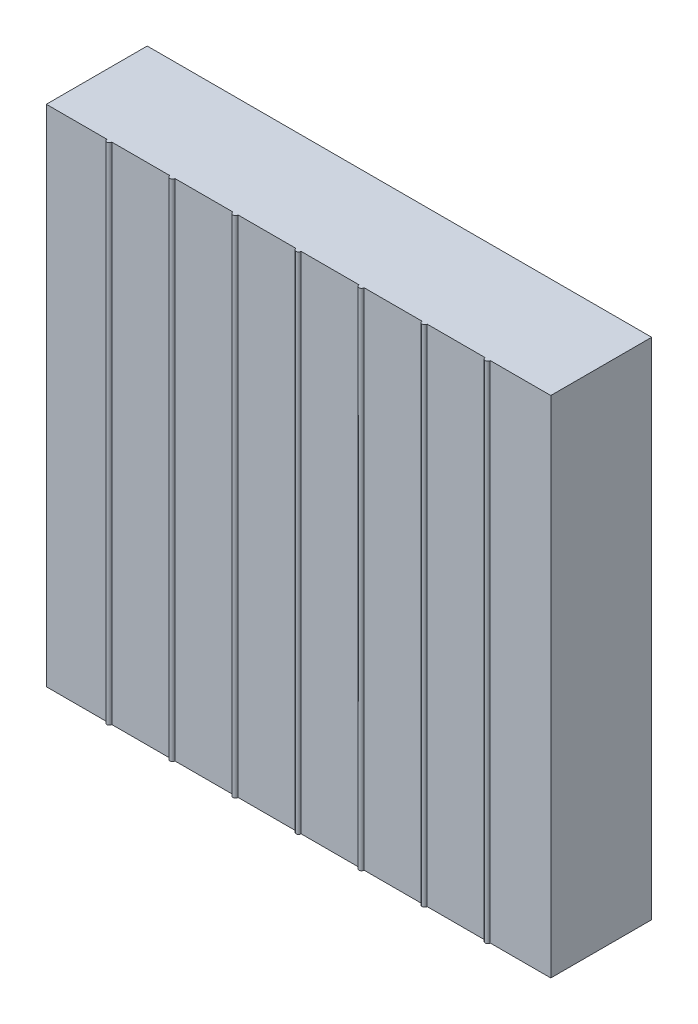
ISO-10303-21;
HEADER;
FILE_DESCRIPTION(('STEP AP214'),'2;1');
FILE_NAME('part.step','',(''),(''),'','','');
FILE_SCHEMA(('AUTOMOTIVE_DESIGN { 1 0 10303 214 1 1 1 1 }'));
ENDSEC;
DATA;
#1=APPLICATION_CONTEXT('core data for automotive mechanical design processes');
#2=APPLICATION_PROTOCOL_DEFINITION('international standard','automotive_design',2000,#1);
#3=PRODUCT_CONTEXT('',#1,'mechanical');
#4=PRODUCT('Part','Part','',(#3));
#5=PRODUCT_RELATED_PRODUCT_CATEGORY('part','',(#4));
#6=PRODUCT_DEFINITION_FORMATION('','',#4);
#7=PRODUCT_DEFINITION_CONTEXT('part definition',#1,'design');
#8=PRODUCT_DEFINITION('design','',#6,#7);
#9=PRODUCT_DEFINITION_SHAPE('','',#8);
#10=(LENGTH_UNIT() NAMED_UNIT(*) SI_UNIT(.MILLI.,.METRE.));
#11=(NAMED_UNIT(*) PLANE_ANGLE_UNIT() SI_UNIT($,.RADIAN.));
#12=(NAMED_UNIT(*) SI_UNIT($,.STERADIAN.) SOLID_ANGLE_UNIT());
#13=UNCERTAINTY_MEASURE_WITH_UNIT(LENGTH_MEASURE(1.E-05),#10,'distance_accuracy_value','');
#14=(GEOMETRIC_REPRESENTATION_CONTEXT(3) GLOBAL_UNCERTAINTY_ASSIGNED_CONTEXT((#13)) GLOBAL_UNIT_ASSIGNED_CONTEXT((#10,
#11,#12)) REPRESENTATION_CONTEXT('',''));
#15=CARTESIAN_POINT('',(0.,0.,0.));
#16=DIRECTION('',(0.,0.,1.));
#17=DIRECTION('',(1.,0.,0.));
#18=AXIS2_PLACEMENT_3D('',#15,#16,#17);
#19=CARTESIAN_POINT('',(-10.,10.,4.));
#20=DIRECTION('',(0.,0.,1.));
#21=DIRECTION('',(1.,0.,0.));
#22=AXIS2_PLACEMENT_3D('',#19,#20,#21);
#23=PLANE('',#22);
#24=DIRECTION('',(0.,1.,0.));
#25=VECTOR('',#24,1.);
#26=CARTESIAN_POINT('',(7.6,-10.22360679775,3.99999999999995));
#27=LINE('',#26,#25);
#28=CARTESIAN_POINT('',(7.6,-10.,4.));
#29=VERTEX_POINT('',#28);
#30=CARTESIAN_POINT('',(7.6,10.,4.));
#31=VERTEX_POINT('',#30);
#32=EDGE_CURVE('E47',#29,#31,#27,.T.);
#33=ORIENTED_EDGE('',*,*,#32,.F.);
#34=DIRECTION('',(1.,0.,0.));
#35=VECTOR('',#34,1.);
#36=CARTESIAN_POINT('',(-10.,-10.,4.));
#37=LINE('',#36,#35);
#38=CARTESIAN_POINT('',(10.,-10.,4.));
#39=VERTEX_POINT('',#38);
#40=EDGE_CURVE('E259',#29,#39,#37,.T.);
#41=ORIENTED_EDGE('',*,*,#40,.T.);
#42=DIRECTION('',(0.,1.,0.));
#43=VECTOR('',#42,1.);
#44=CARTESIAN_POINT('',(10.,10.,4.));
#45=LINE('',#44,#43);
#46=CARTESIAN_POINT('',(10.,10.,4.));
#47=VERTEX_POINT('',#46);
#48=EDGE_CURVE('E262',#39,#47,#45,.T.);
#49=ORIENTED_EDGE('',*,*,#48,.T.);
#50=DIRECTION('',(-1.,0.,0.));
#51=VECTOR('',#50,1.);
#52=CARTESIAN_POINT('',(-10.,10.,4.));
#53=LINE('',#52,#51);
#54=EDGE_CURVE('E166',#47,#31,#53,.T.);
#55=ORIENTED_EDGE('',*,*,#54,.T.);
#56=EDGE_LOOP('',(#33,#41,#49,#55));
#57=FACE_BOUND('',#56,.T.);
#58=ADVANCED_FACE('F32',(#57),#23,.T.);
#59=DIRECTION('',(0.,1.,0.));
#60=VECTOR('',#59,1.);
#61=CARTESIAN_POINT('',(7.4,-10.22360679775,3.99999999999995));
#62=LINE('',#61,#60);
#63=CARTESIAN_POINT('',(7.4,-10.,4.));
#64=VERTEX_POINT('',#63);
#65=CARTESIAN_POINT('',(7.4,10.,3.99999999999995));
#66=VERTEX_POINT('',#65);
#67=EDGE_CURVE('E170',#64,#66,#62,.T.);
#68=ORIENTED_EDGE('',*,*,#67,.T.);
#69=CARTESIAN_POINT('',(5.1,10.,4.));
#70=VERTEX_POINT('',#69);
#71=EDGE_CURVE('E158',#66,#70,#53,.T.);
#72=ORIENTED_EDGE('',*,*,#71,.T.);
#73=DIRECTION('',(0.,1.,0.));
#74=VECTOR('',#73,1.);
#75=CARTESIAN_POINT('',(5.1,-10.22360679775,3.99999999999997));
#76=LINE('',#75,#74);
#77=CARTESIAN_POINT('',(5.1,-10.,4.));
#78=VERTEX_POINT('',#77);
#79=EDGE_CURVE('E187',#78,#70,#76,.T.);
#80=ORIENTED_EDGE('',*,*,#79,.F.);
#81=EDGE_CURVE('E55',#78,#64,#37,.T.);
#82=ORIENTED_EDGE('',*,*,#81,.T.);
#83=EDGE_LOOP('',(#68,#72,#80,#82));
#84=FACE_BOUND('',#83,.T.);
#85=ADVANCED_FACE('F171',(#84),#23,.T.);
#86=DIRECTION('',(0.,1.,0.));
#87=VECTOR('',#86,1.);
#88=CARTESIAN_POINT('',(4.9,-10.22360679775,3.99999999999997));
#89=LINE('',#88,#87);
#90=CARTESIAN_POINT('',(4.9,-10.,4.));
#91=VERTEX_POINT('',#90);
#92=CARTESIAN_POINT('',(4.9,10.,3.99999999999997));
#93=VERTEX_POINT('',#92);
#94=EDGE_CURVE('E185',#91,#93,#89,.T.);
#95=ORIENTED_EDGE('',*,*,#94,.T.);
#96=CARTESIAN_POINT('',(2.6,10.,4.));
#97=VERTEX_POINT('',#96);
#98=EDGE_CURVE('E167',#93,#97,#53,.T.);
#99=ORIENTED_EDGE('',*,*,#98,.T.);
#100=DIRECTION('',(0.,1.,0.));
#101=VECTOR('',#100,1.);
#102=CARTESIAN_POINT('',(2.6,-10.22360679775,3.99999999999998));
#103=LINE('',#102,#101);
#104=CARTESIAN_POINT('',(2.6,-10.,4.));
#105=VERTEX_POINT('',#104);
#106=EDGE_CURVE('E198',#105,#97,#103,.T.);
#107=ORIENTED_EDGE('',*,*,#106,.F.);
#108=EDGE_CURVE('E322',#105,#91,#37,.T.);
#109=ORIENTED_EDGE('',*,*,#108,.T.);
#110=EDGE_LOOP('',(#95,#99,#107,#109));
#111=FACE_BOUND('',#110,.T.);
#112=ADVANCED_FACE('F331',(#111),#23,.T.);
#113=DIRECTION('',(0.,1.,0.));
#114=VECTOR('',#113,1.);
#115=CARTESIAN_POINT('',(-7.4,-10.22360679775,4.));
#116=LINE('',#115,#114);
#117=CARTESIAN_POINT('',(-7.4,-10.,4.));
#118=VERTEX_POINT('',#117);
#119=CARTESIAN_POINT('',(-7.4,10.,4.));
#120=VERTEX_POINT('',#119);
#121=EDGE_CURVE('E210',#118,#120,#116,.T.);
#122=ORIENTED_EDGE('',*,*,#121,.F.);
#123=CARTESIAN_POINT('',(-5.1,-10.,4.));
#124=VERTEX_POINT('',#123);
#125=EDGE_CURVE('E263',#118,#124,#37,.T.);
#126=ORIENTED_EDGE('',*,*,#125,.T.);
#127=DIRECTION('',(0.,1.,0.));
#128=VECTOR('',#127,1.);
#129=CARTESIAN_POINT('',(-5.1,-10.22360679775,4.));
#130=LINE('',#129,#128);
#131=CARTESIAN_POINT('',(-5.1,10.,4.));
#132=VERTEX_POINT('',#131);
#133=EDGE_CURVE('E218',#124,#132,#130,.T.);
#134=ORIENTED_EDGE('',*,*,#133,.T.);
#135=EDGE_CURVE('E294',#132,#120,#53,.T.);
#136=ORIENTED_EDGE('',*,*,#135,.T.);
#137=EDGE_LOOP('',(#122,#126,#134,#136));
#138=FACE_BOUND('',#137,.T.);
#139=ADVANCED_FACE('F316',(#138),#23,.T.);
#140=DIRECTION('',(0.,1.,0.));
#141=VECTOR('',#140,1.);
#142=CARTESIAN_POINT('',(-4.9,-10.22360679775,4.));
#143=LINE('',#142,#141);
#144=CARTESIAN_POINT('',(-4.9,-10.,4.));
#145=VERTEX_POINT('',#144);
#146=CARTESIAN_POINT('',(-4.9,10.,4.));
#147=VERTEX_POINT('',#146);
#148=EDGE_CURVE('E221',#145,#147,#143,.T.);
#149=ORIENTED_EDGE('',*,*,#148,.F.);
#150=CARTESIAN_POINT('',(-2.6,-10.,4.));
#151=VERTEX_POINT('',#150);
#152=EDGE_CURVE('E321',#145,#151,#37,.T.);
#153=ORIENTED_EDGE('',*,*,#152,.T.);
#154=DIRECTION('',(0.,1.,0.));
#155=VECTOR('',#154,1.);
#156=CARTESIAN_POINT('',(-2.6,-10.22360679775,4.));
#157=LINE('',#156,#155);
#158=CARTESIAN_POINT('',(-2.6,10.,4.));
#159=VERTEX_POINT('',#158);
#160=EDGE_CURVE('E229',#151,#159,#157,.T.);
#161=ORIENTED_EDGE('',*,*,#160,.T.);
#162=EDGE_CURVE('E296',#159,#147,#53,.T.);
#163=ORIENTED_EDGE('',*,*,#162,.T.);
#164=EDGE_LOOP('',(#149,#153,#161,#163));
#165=FACE_BOUND('',#164,.T.);
#166=ADVANCED_FACE('F305',(#165),#23,.T.);
#167=DIRECTION('',(0.,1.,0.));
#168=VECTOR('',#167,1.);
#169=CARTESIAN_POINT('',(-2.4,-10.22360679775,4.));
#170=LINE('',#169,#168);
#171=CARTESIAN_POINT('',(-2.4,-10.,4.));
#172=VERTEX_POINT('',#171);
#173=CARTESIAN_POINT('',(-2.4,10.,4.));
#174=VERTEX_POINT('',#173);
#175=EDGE_CURVE('E232',#172,#174,#170,.T.);
#176=ORIENTED_EDGE('',*,*,#175,.F.);
#177=CARTESIAN_POINT('',(-0.100000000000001,-10.,4.));
#178=VERTEX_POINT('',#177);
#179=EDGE_CURVE('E323',#172,#178,#37,.T.);
#180=ORIENTED_EDGE('',*,*,#179,.T.);
#181=DIRECTION('',(0.,1.,0.));
#182=VECTOR('',#181,1.);
#183=CARTESIAN_POINT('',(-0.1,-10.22360679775,4.));
#184=LINE('',#183,#182);
#185=CARTESIAN_POINT('',(-0.100000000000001,10.,4.));
#186=VERTEX_POINT('',#185);
#187=EDGE_CURVE('E241',#178,#186,#184,.T.);
#188=ORIENTED_EDGE('',*,*,#187,.T.);
#189=EDGE_CURVE('E268',#186,#174,#53,.T.);
#190=ORIENTED_EDGE('',*,*,#189,.T.);
#191=EDGE_LOOP('',(#176,#180,#188,#190));
#192=FACE_BOUND('',#191,.T.);
#193=ADVANCED_FACE('F343',(#192),#23,.T.);
#194=DIRECTION('',(0.,1.,0.));
#195=VECTOR('',#194,1.);
#196=CARTESIAN_POINT('',(2.4,-10.22360679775,3.99999999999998));
#197=LINE('',#196,#195);
#198=CARTESIAN_POINT('',(2.4,-10.,4.));
#199=VERTEX_POINT('',#198);
#200=CARTESIAN_POINT('',(2.4,10.,3.99999999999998));
#201=VERTEX_POINT('',#200);
#202=EDGE_CURVE('E195',#199,#201,#197,.T.);
#203=ORIENTED_EDGE('',*,*,#202,.T.);
#204=CARTESIAN_POINT('',(0.100000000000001,10.,4.));
#205=VERTEX_POINT('',#204);
#206=EDGE_CURVE('E295',#201,#205,#53,.T.);
#207=ORIENTED_EDGE('',*,*,#206,.T.);
#208=DIRECTION('',(0.,1.,0.));
#209=VECTOR('',#208,1.);
#210=CARTESIAN_POINT('',(0.1,-10.22360679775,4.));
#211=LINE('',#210,#209);
#212=CARTESIAN_POINT('',(0.1,-10.,4.));
#213=VERTEX_POINT('',#212);
#214=EDGE_CURVE('E244',#213,#205,#211,.T.);
#215=ORIENTED_EDGE('',*,*,#214,.F.);
#216=EDGE_CURVE('E264',#213,#199,#37,.T.);
#217=ORIENTED_EDGE('',*,*,#216,.T.);
#218=EDGE_LOOP('',(#203,#207,#215,#217));
#219=FACE_BOUND('',#218,.T.);
#220=ADVANCED_FACE('F338',(#219),#23,.T.);
#221=CARTESIAN_POINT('',(-10.,10.,4.));
#222=DIRECTION('',(1.,0.,0.));
#223=DIRECTION('',(0.,0.,-1.));
#224=AXIS2_PLACEMENT_3D('',#221,#222,#223);
#225=PLANE('',#224);
#226=DIRECTION('',(0.,-1.,0.));
#227=VECTOR('',#226,1.);
#228=CARTESIAN_POINT('',(-10.,10.,0.));
#229=LINE('',#228,#227);
#230=CARTESIAN_POINT('',(-10.,10.,0.));
#231=VERTEX_POINT('',#230);
#232=CARTESIAN_POINT('',(-10.,-10.,0.));
#233=VERTEX_POINT('',#232);
#234=EDGE_CURVE('E240',#231,#233,#229,.T.);
#235=ORIENTED_EDGE('',*,*,#234,.T.);
#236=DIRECTION('',(0.,0.,-1.));
#237=VECTOR('',#236,1.);
#238=CARTESIAN_POINT('',(-10.,-10.,4.));
#239=LINE('',#238,#237);
#240=CARTESIAN_POINT('',(-10.,-10.,4.));
#241=VERTEX_POINT('',#240);
#242=EDGE_CURVE('E11',#241,#233,#239,.T.);
#243=ORIENTED_EDGE('',*,*,#242,.F.);
#244=DIRECTION('',(0.,-1.,0.));
#245=VECTOR('',#244,1.);
#246=CARTESIAN_POINT('',(-10.,10.,4.));
#247=LINE('',#246,#245);
#248=CARTESIAN_POINT('',(-10.,10.,4.));
#249=VERTEX_POINT('',#248);
#250=EDGE_CURVE('E256',#249,#241,#247,.T.);
#251=ORIENTED_EDGE('',*,*,#250,.F.);
#252=DIRECTION('',(0.,0.,-1.));
#253=VECTOR('',#252,1.);
#254=CARTESIAN_POINT('',(-10.,10.,4.));
#255=LINE('',#254,#253);
#256=EDGE_CURVE('E267',#249,#231,#255,.T.);
#257=ORIENTED_EDGE('',*,*,#256,.T.);
#258=EDGE_LOOP('',(#235,#243,#251,#257));
#259=FACE_BOUND('',#258,.T.);
#260=ADVANCED_FACE('F34',(#259),#225,.F.);
#261=CARTESIAN_POINT('',(-10.,-10.,4.));
#262=DIRECTION('',(0.,1.,0.));
#263=DIRECTION('',(-1.,0.,0.));
#264=AXIS2_PLACEMENT_3D('',#261,#262,#263);
#265=PLANE('',#264);
#266=DIRECTION('',(1.,0.,0.));
#267=VECTOR('',#266,1.);
#268=CARTESIAN_POINT('',(-10.,-10.,0.));
#269=LINE('',#268,#267);
#270=CARTESIAN_POINT('',(10.,-10.,0.));
#271=VERTEX_POINT('',#270);
#272=EDGE_CURVE('E250',#233,#271,#269,.T.);
#273=ORIENTED_EDGE('',*,*,#272,.T.);
#274=DIRECTION('',(0.,0.,-1.));
#275=VECTOR('',#274,1.);
#276=CARTESIAN_POINT('',(10.,-10.,4.));
#277=LINE('',#276,#275);
#278=EDGE_CURVE('E40',#39,#271,#277,.T.);
#279=ORIENTED_EDGE('',*,*,#278,.F.);
#280=ORIENTED_EDGE('',*,*,#40,.F.);
#281=CARTESIAN_POINT('',(7.5,-10.,3.99999999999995));
#282=DIRECTION('',(0.,1.,0.));
#283=DIRECTION('',(-1.,0.,0.));
#284=AXIS2_PLACEMENT_3D('',#281,#282,#283);
#285=CIRCLE('',#284,0.1);
#286=EDGE_CURVE('E174',#29,#64,#285,.F.);
#287=ORIENTED_EDGE('',*,*,#286,.T.);
#288=ORIENTED_EDGE('',*,*,#81,.F.);
#289=CARTESIAN_POINT('',(5.,-10.,3.99999999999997));
#290=DIRECTION('',(0.,1.,0.));
#291=DIRECTION('',(-1.,0.,0.));
#292=AXIS2_PLACEMENT_3D('',#289,#290,#291);
#293=CIRCLE('',#292,0.1);
#294=EDGE_CURVE('E181',#78,#91,#293,.F.);
#295=ORIENTED_EDGE('',*,*,#294,.T.);
#296=ORIENTED_EDGE('',*,*,#108,.F.);
#297=CARTESIAN_POINT('',(2.5,-10.,3.99999999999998));
#298=DIRECTION('',(0.,1.,0.));
#299=DIRECTION('',(-1.,0.,0.));
#300=AXIS2_PLACEMENT_3D('',#297,#298,#299);
#301=CIRCLE('',#300,0.1);
#302=EDGE_CURVE('E191',#105,#199,#301,.F.);
#303=ORIENTED_EDGE('',*,*,#302,.T.);
#304=ORIENTED_EDGE('',*,*,#216,.F.);
#305=CARTESIAN_POINT('',(0.,-10.,4.));
#306=DIRECTION('',(0.,1.,0.));
#307=DIRECTION('',(-1.,0.,0.));
#308=AXIS2_PLACEMENT_3D('',#305,#306,#307);
#309=CIRCLE('',#308,0.1);
#310=EDGE_CURVE('E237',#213,#178,#309,.F.);
#311=ORIENTED_EDGE('',*,*,#310,.T.);
#312=ORIENTED_EDGE('',*,*,#179,.F.);
#313=CARTESIAN_POINT('',(-2.5,-10.,4.));
#314=DIRECTION('',(0.,1.,0.));
#315=DIRECTION('',(-1.,0.,0.));
#316=AXIS2_PLACEMENT_3D('',#313,#314,#315);
#317=CIRCLE('',#316,0.1);
#318=EDGE_CURVE('E225',#172,#151,#317,.F.);
#319=ORIENTED_EDGE('',*,*,#318,.T.);
#320=ORIENTED_EDGE('',*,*,#152,.F.);
#321=CARTESIAN_POINT('',(-5.,-10.,4.));
#322=DIRECTION('',(0.,1.,0.));
#323=DIRECTION('',(-1.,0.,0.));
#324=AXIS2_PLACEMENT_3D('',#321,#322,#323);
#325=CIRCLE('',#324,0.1);
#326=EDGE_CURVE('E214',#145,#124,#325,.F.);
#327=ORIENTED_EDGE('',*,*,#326,.T.);
#328=ORIENTED_EDGE('',*,*,#125,.F.);
#329=CARTESIAN_POINT('',(-7.5,-10.,4.));
#330=DIRECTION('',(0.,1.,0.));
#331=DIRECTION('',(-1.,0.,0.));
#332=AXIS2_PLACEMENT_3D('',#329,#330,#331);
#333=CIRCLE('',#332,0.1);
#334=CARTESIAN_POINT('',(-7.6,-10.,4.));
#335=VERTEX_POINT('',#334);
#336=EDGE_CURVE('E203',#118,#335,#333,.F.);
#337=ORIENTED_EDGE('',*,*,#336,.T.);
#338=EDGE_CURVE('E260',#241,#335,#37,.T.);
#339=ORIENTED_EDGE('',*,*,#338,.F.);
#340=ORIENTED_EDGE('',*,*,#242,.T.);
#341=EDGE_LOOP('',(#273,#279,#280,#287,#288,#295,#296,#303,#304,#311,#312,#319,#320,#327,#328,
#337,#339,#340));
#342=FACE_BOUND('',#341,.T.);
#343=ADVANCED_FACE('F320',(#342),#265,.F.);
#344=CARTESIAN_POINT('',(10.,10.,4.));
#345=DIRECTION('',(-1.,0.,0.));
#346=DIRECTION('',(0.,-1.,0.));
#347=AXIS2_PLACEMENT_3D('',#344,#345,#346);
#348=PLANE('',#347);
#349=DIRECTION('',(0.,1.,0.));
#350=VECTOR('',#349,1.);
#351=CARTESIAN_POINT('',(10.,10.,0.));
#352=LINE('',#351,#350);
#353=CARTESIAN_POINT('',(10.,10.,0.));
#354=VERTEX_POINT('',#353);
#355=EDGE_CURVE('E252',#271,#354,#352,.T.);
#356=ORIENTED_EDGE('',*,*,#355,.T.);
#357=DIRECTION('',(0.,0.,-1.));
#358=VECTOR('',#357,1.);
#359=CARTESIAN_POINT('',(10.,10.,4.));
#360=LINE('',#359,#358);
#361=EDGE_CURVE('E271',#47,#354,#360,.T.);
#362=ORIENTED_EDGE('',*,*,#361,.F.);
#363=ORIENTED_EDGE('',*,*,#48,.F.);
#364=ORIENTED_EDGE('',*,*,#278,.T.);
#365=EDGE_LOOP('',(#356,#362,#363,#364));
#366=FACE_BOUND('',#365,.T.);
#367=ADVANCED_FACE('F278',(#366),#348,.F.);
#368=CARTESIAN_POINT('',(-10.,10.,4.));
#369=DIRECTION('',(0.,-1.,0.));
#370=DIRECTION('',(0.,0.,-1.));
#371=AXIS2_PLACEMENT_3D('',#368,#369,#370);
#372=PLANE('',#371);
#373=DIRECTION('',(-1.,0.,0.));
#374=VECTOR('',#373,1.);
#375=CARTESIAN_POINT('',(-10.,10.,0.));
#376=LINE('',#375,#374);
#377=EDGE_CURVE('E254',#354,#231,#376,.T.);
#378=ORIENTED_EDGE('',*,*,#377,.T.);
#379=ORIENTED_EDGE('',*,*,#256,.F.);
#380=CARTESIAN_POINT('',(-7.6,10.,4.));
#381=VERTEX_POINT('',#380);
#382=EDGE_CURVE('E265',#381,#249,#53,.T.);
#383=ORIENTED_EDGE('',*,*,#382,.F.);
#384=CARTESIAN_POINT('',(-7.5,10.,4.));
#385=DIRECTION('',(0.,1.,0.));
#386=DIRECTION('',(0.,0.,1.));
#387=AXIS2_PLACEMENT_3D('',#384,#385,#386);
#388=CIRCLE('',#387,0.1);
#389=EDGE_CURVE('E194',#381,#120,#388,.T.);
#390=ORIENTED_EDGE('',*,*,#389,.T.);
#391=ORIENTED_EDGE('',*,*,#135,.F.);
#392=CARTESIAN_POINT('',(-5.,10.,4.));
#393=DIRECTION('',(0.,1.,0.));
#394=DIRECTION('',(0.,0.,1.));
#395=AXIS2_PLACEMENT_3D('',#392,#393,#394);
#396=CIRCLE('',#395,0.1);
#397=EDGE_CURVE('E206',#132,#147,#396,.T.);
#398=ORIENTED_EDGE('',*,*,#397,.T.);
#399=ORIENTED_EDGE('',*,*,#162,.F.);
#400=CARTESIAN_POINT('',(-2.5,10.,4.));
#401=DIRECTION('',(0.,1.,0.));
#402=DIRECTION('',(0.,0.,1.));
#403=AXIS2_PLACEMENT_3D('',#400,#401,#402);
#404=CIRCLE('',#403,0.1);
#405=EDGE_CURVE('E217',#159,#174,#404,.T.);
#406=ORIENTED_EDGE('',*,*,#405,.T.);
#407=ORIENTED_EDGE('',*,*,#189,.F.);
#408=CARTESIAN_POINT('',(0.,10.,4.));
#409=DIRECTION('',(0.,1.,0.));
#410=DIRECTION('',(0.,0.,1.));
#411=AXIS2_PLACEMENT_3D('',#408,#409,#410);
#412=CIRCLE('',#411,0.1);
#413=EDGE_CURVE('E228',#186,#205,#412,.T.);
#414=ORIENTED_EDGE('',*,*,#413,.T.);
#415=ORIENTED_EDGE('',*,*,#206,.F.);
#416=CARTESIAN_POINT('',(2.5,10.,3.99999999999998));
#417=DIRECTION('',(0.,1.,0.));
#418=DIRECTION('',(0.,0.,1.));
#419=AXIS2_PLACEMENT_3D('',#416,#417,#418);
#420=CIRCLE('',#419,0.1);
#421=EDGE_CURVE('E184',#201,#97,#420,.T.);
#422=ORIENTED_EDGE('',*,*,#421,.T.);
#423=ORIENTED_EDGE('',*,*,#98,.F.);
#424=CARTESIAN_POINT('',(5.,10.,3.99999999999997));
#425=DIRECTION('',(0.,1.,0.));
#426=DIRECTION('',(0.,0.,1.));
#427=AXIS2_PLACEMENT_3D('',#424,#425,#426);
#428=CIRCLE('',#427,0.1);
#429=EDGE_CURVE('E164',#93,#70,#428,.T.);
#430=ORIENTED_EDGE('',*,*,#429,.T.);
#431=ORIENTED_EDGE('',*,*,#71,.F.);
#432=CARTESIAN_POINT('',(7.5,10.,3.99999999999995));
#433=DIRECTION('',(0.,1.,0.));
#434=DIRECTION('',(0.,0.,1.));
#435=AXIS2_PLACEMENT_3D('',#432,#433,#434);
#436=CIRCLE('',#435,0.1);
#437=EDGE_CURVE('E162',#66,#31,#436,.T.);
#438=ORIENTED_EDGE('',*,*,#437,.T.);
#439=ORIENTED_EDGE('',*,*,#54,.F.);
#440=ORIENTED_EDGE('',*,*,#361,.T.);
#441=EDGE_LOOP('',(#378,#379,#383,#390,#391,#398,#399,#406,#407,#414,#415,#422,#423,#430,#431,
#438,#439,#440));
#442=FACE_BOUND('',#441,.T.);
#443=ADVANCED_FACE('F159',(#442),#372,.F.);
#444=DIRECTION('',(0.,1.,0.));
#445=VECTOR('',#444,1.);
#446=CARTESIAN_POINT('',(-7.6,-10.22360679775,4.));
#447=LINE('',#446,#445);
#448=EDGE_CURVE('E207',#335,#381,#447,.T.);
#449=ORIENTED_EDGE('',*,*,#448,.T.);
#450=ORIENTED_EDGE('',*,*,#382,.T.);
#451=ORIENTED_EDGE('',*,*,#250,.T.);
#452=ORIENTED_EDGE('',*,*,#338,.T.);
#453=EDGE_LOOP('',(#449,#450,#451,#452));
#454=FACE_BOUND('',#453,.T.);
#455=ADVANCED_FACE('F291',(#454),#23,.T.);
#456=CARTESIAN_POINT('',(-10.,10.,0.));
#457=DIRECTION('',(0.,0.,1.));
#458=DIRECTION('',(1.,0.,0.));
#459=AXIS2_PLACEMENT_3D('',#456,#457,#458);
#460=PLANE('',#459);
#461=ORIENTED_EDGE('',*,*,#234,.F.);
#462=ORIENTED_EDGE('',*,*,#377,.F.);
#463=ORIENTED_EDGE('',*,*,#355,.F.);
#464=ORIENTED_EDGE('',*,*,#272,.F.);
#465=EDGE_LOOP('',(#461,#462,#463,#464));
#466=FACE_BOUND('',#465,.T.);
#467=ADVANCED_FACE('F284',(#466),#460,.F.);
#468=CARTESIAN_POINT('',(0.,-10.22360679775,4.));
#469=DIRECTION('',(0.,1.,0.));
#470=DIRECTION('',(0.,0.,1.));
#471=AXIS2_PLACEMENT_3D('',#468,#469,#470);
#472=CYLINDRICAL_SURFACE('',#471,0.1);
#473=ORIENTED_EDGE('',*,*,#310,.F.);
#474=ORIENTED_EDGE('',*,*,#214,.T.);
#475=ORIENTED_EDGE('',*,*,#413,.F.);
#476=ORIENTED_EDGE('',*,*,#187,.F.);
#477=EDGE_LOOP('',(#473,#474,#475,#476));
#478=FACE_BOUND('',#477,.T.);
#479=ADVANCED_FACE('F342',(#478),#472,.T.);
#480=CARTESIAN_POINT('',(-2.5,-10.22360679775,4.));
#481=DIRECTION('',(0.,1.,0.));
#482=DIRECTION('',(0.,0.,1.));
#483=AXIS2_PLACEMENT_3D('',#480,#481,#482);
#484=CYLINDRICAL_SURFACE('',#483,0.1);
#485=ORIENTED_EDGE('',*,*,#318,.F.);
#486=ORIENTED_EDGE('',*,*,#175,.T.);
#487=ORIENTED_EDGE('',*,*,#405,.F.);
#488=ORIENTED_EDGE('',*,*,#160,.F.);
#489=EDGE_LOOP('',(#485,#486,#487,#488));
#490=FACE_BOUND('',#489,.T.);
#491=ADVANCED_FACE('F346',(#490),#484,.T.);
#492=CARTESIAN_POINT('',(-5.,-10.22360679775,4.));
#493=DIRECTION('',(0.,1.,0.));
#494=DIRECTION('',(0.,0.,1.));
#495=AXIS2_PLACEMENT_3D('',#492,#493,#494);
#496=CYLINDRICAL_SURFACE('',#495,0.1);
#497=ORIENTED_EDGE('',*,*,#326,.F.);
#498=ORIENTED_EDGE('',*,*,#148,.T.);
#499=ORIENTED_EDGE('',*,*,#397,.F.);
#500=ORIENTED_EDGE('',*,*,#133,.F.);
#501=EDGE_LOOP('',(#497,#498,#499,#500));
#502=FACE_BOUND('',#501,.T.);
#503=ADVANCED_FACE('F311',(#502),#496,.T.);
#504=CARTESIAN_POINT('',(-7.5,-10.22360679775,4.));
#505=DIRECTION('',(0.,1.,0.));
#506=DIRECTION('',(0.,0.,1.));
#507=AXIS2_PLACEMENT_3D('',#504,#505,#506);
#508=CYLINDRICAL_SURFACE('',#507,0.1);
#509=ORIENTED_EDGE('',*,*,#336,.F.);
#510=ORIENTED_EDGE('',*,*,#121,.T.);
#511=ORIENTED_EDGE('',*,*,#389,.F.);
#512=ORIENTED_EDGE('',*,*,#448,.F.);
#513=EDGE_LOOP('',(#509,#510,#511,#512));
#514=FACE_BOUND('',#513,.T.);
#515=ADVANCED_FACE('F319',(#514),#508,.T.);
#516=CARTESIAN_POINT('',(2.5,-10.22360679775,3.99999999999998));
#517=DIRECTION('',(0.,1.,0.));
#518=DIRECTION('',(0.,0.,1.));
#519=AXIS2_PLACEMENT_3D('',#516,#517,#518);
#520=CYLINDRICAL_SURFACE('',#519,0.1);
#521=ORIENTED_EDGE('',*,*,#302,.F.);
#522=ORIENTED_EDGE('',*,*,#106,.T.);
#523=ORIENTED_EDGE('',*,*,#421,.F.);
#524=ORIENTED_EDGE('',*,*,#202,.F.);
#525=EDGE_LOOP('',(#521,#522,#523,#524));
#526=FACE_BOUND('',#525,.T.);
#527=ADVANCED_FACE('F335',(#526),#520,.T.);
#528=CARTESIAN_POINT('',(5.,-10.22360679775,3.99999999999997));
#529=DIRECTION('',(0.,1.,0.));
#530=DIRECTION('',(0.,0.,1.));
#531=AXIS2_PLACEMENT_3D('',#528,#529,#530);
#532=CYLINDRICAL_SURFACE('',#531,0.1);
#533=ORIENTED_EDGE('',*,*,#294,.F.);
#534=ORIENTED_EDGE('',*,*,#79,.T.);
#535=ORIENTED_EDGE('',*,*,#429,.F.);
#536=ORIENTED_EDGE('',*,*,#94,.F.);
#537=EDGE_LOOP('',(#533,#534,#535,#536));
#538=FACE_BOUND('',#537,.T.);
#539=ADVANCED_FACE('F330',(#538),#532,.T.);
#540=CARTESIAN_POINT('',(7.5,-10.22360679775,3.99999999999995));
#541=DIRECTION('',(0.,1.,0.));
#542=DIRECTION('',(0.,0.,1.));
#543=AXIS2_PLACEMENT_3D('',#540,#541,#542);
#544=CYLINDRICAL_SURFACE('',#543,0.1);
#545=ORIENTED_EDGE('',*,*,#286,.F.);
#546=ORIENTED_EDGE('',*,*,#32,.T.);
#547=ORIENTED_EDGE('',*,*,#437,.F.);
#548=ORIENTED_EDGE('',*,*,#67,.F.);
#549=EDGE_LOOP('',(#545,#546,#547,#548));
#550=FACE_BOUND('',#549,.T.);
#551=ADVANCED_FACE('F176',(#550),#544,.T.);
#552=CLOSED_SHELL('',(#58,#85,#112,#139,#166,#193,#220,#260,#343,#367,#443,#455,#467,#479,#491,
#503,#515,#527,#539,#551));
#553=MANIFOLD_SOLID_BREP('B2',#552);
#554=ADVANCED_BREP_SHAPE_REPRESENTATION('',(#18,#553),#14);
#555=SHAPE_DEFINITION_REPRESENTATION(#9,#554);
ENDSEC;
END-ISO-10303-21;
